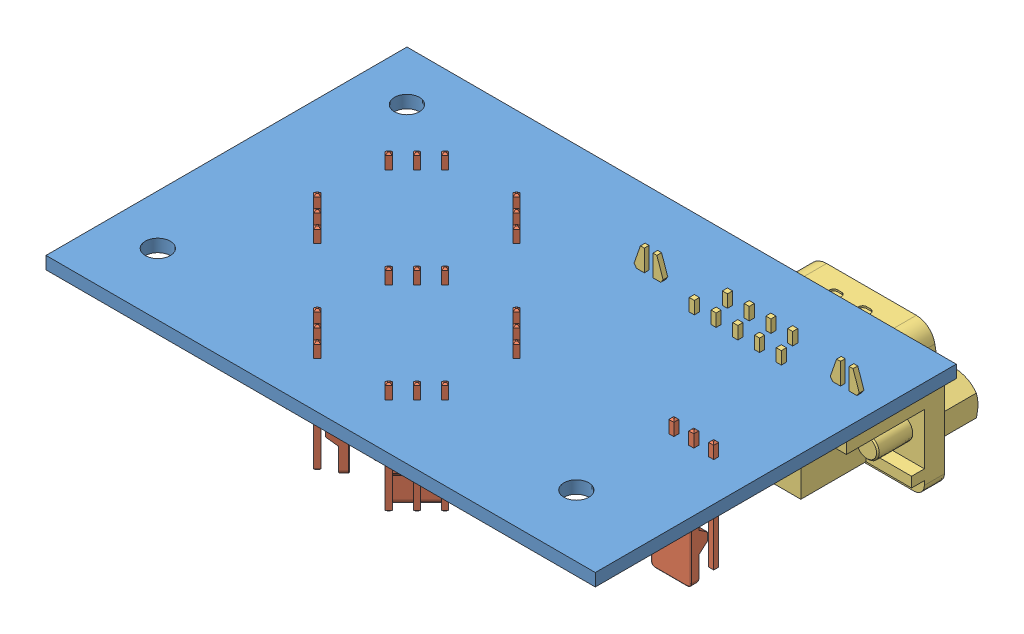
SolidWorks assembly Servo-Distibrution-PCB.sldasm, configuration Default (file format 8000). Lengths in mm.
Overall size (70 16.88 52.1).
10 component instances, 3 part files, 2 mates.
Components (placement in the parent):
- Servo-Distibrution-PCB-1: Servo-Distibrution-PCB.sldprt [Default] at (0 1.6 0) x (0 0 -1) z (0 -1 0) size (46 70 1.6)
- TinkerKit-3pinMale-24: TinkerKit-3pinMale.sldprt [Default] at (-21.03 0 -10.3) x (-0.707107 0 -0.707107) z (0 -1 0) size (5.82 7.66 14.9)
- TinkerKit-3pinMale-21: TinkerKit-3pinMale.sldprt [Default] at (-8.3304 0 2.3996) x (-0.707107 0 -0.707107) z (0 -1 0) size (5.82 7.66 14.9)
- TinkerKit-3pinMale-26: TinkerKit-3pinMale.sldprt [Default] at (4.3693 0 15.0993) x (0.707107 0 0.707107) z (0 -1 0) size (5.82 7.66 14.9)
- TinkerKit-3pinMale-25: TinkerKit-3pinMale.sldprt [Default] at (-8.33 0 -10.3004) x (0.707107 0 -0.707107) z (0 -1 0) size (5.82 7.66 14.9)
- TinkerKit-3pinMale-20: TinkerKit-3pinMale.sldprt [Default] at (4.3696 0 2.3993) x (0.707107 0 -0.707107) z (0 -1 0) size (5.82 7.66 14.9)
- TinkerKit-3pinMale-23: TinkerKit-3pinMale.sldprt [Default] at (-8.3307 0 15.0982) x (-0.707107 0 0.707107) z (0 -1 0) size (5.82 7.66 14.9)
- TinkerKit-3pinMale-22: TinkerKit-3pinMale.sldprt [Default] at (-21.0304 0 2.3986) x (-0.707107 0 0.707107) z (0 -1 0) size (5.82 7.66 14.9)
- TinkerKit-3pinMale-19: TinkerKit-3pinMale.sldprt [Default] at (27.2279 0 2.68) x (0 0 -1) z (0 -1 0) size (5.82 7.66 14.9)
- D-Sub-9-Vinkel-Print-1: D-Sub-9-Vinkel-Print.SLDPRT [Défaut] at (18.095 -6.275 -23) x (1 0 0) z (0 0 -1) size (30.81 16.88 18.6)
Mates (geometry in assembly coordinates):
- Coincident1: coincident aligned: plane of Servo-Distibrution-PCB-1 through (-35 1.6 -23) normal (0 0 -1); plane of D-Sub-9-Vinkel-Print-1 through (18.095 -6.275 -23) normal (0 0 -1)
- Coincident2: coincident anti-aligned: plane of Servo-Distibrution-PCB-1 through (0 0 0) normal (0 -1 0); plane of D-Sub-9-Vinkel-Print-1 through (32.2 0 -10.5) normal (0 1 0)
